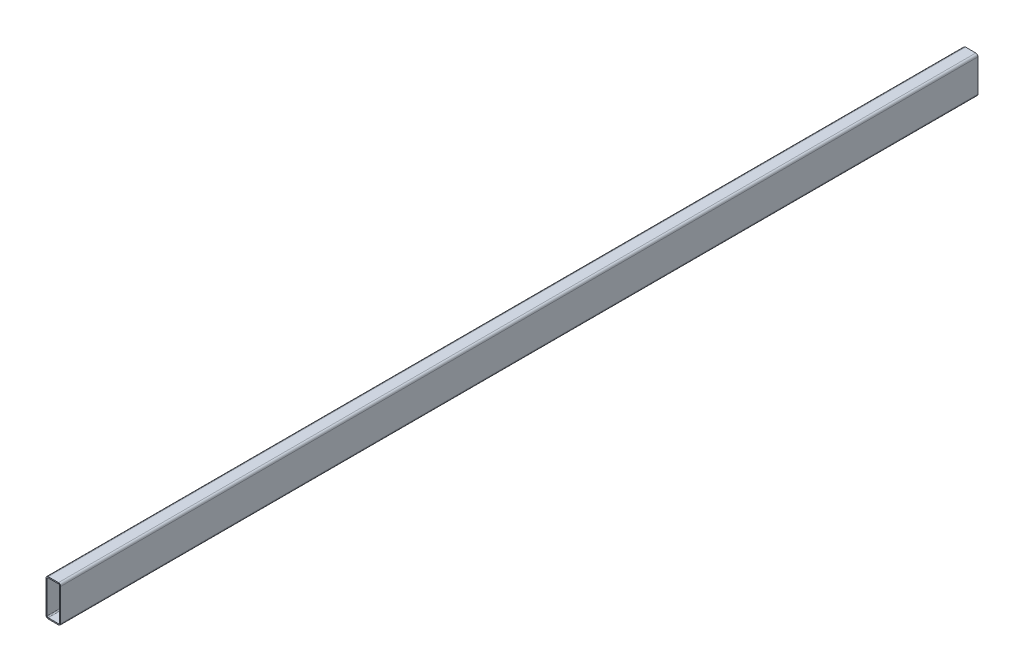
from build123d import *

# Parameters (mm, degrees)
EXTRUSION1_DEPTH = 2500


with BuildPart() as part:
    # Esquisse1 → Extrusion1 (new body)
    with BuildSketch(Plane.XY):
        with BuildLine():
            Line((6, 0), (34, 0))
            ThreePointArc((34, 0), (38.242640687, 1.757359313), (40, 6))
            Line((40, 6), (40, 94))
            ThreePointArc((40, 94), (38.242640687, 98.242640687), (34, 100))
            Line((34, 100), (6, 100))
            ThreePointArc((6, 100), (1.757359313, 98.242640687), (0, 94))
            Line((0, 94), (0, 6))
            ThreePointArc((0, 6), (1.757359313, 1.757359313), (6, 0))
        make_face()
        with BuildLine():
            Line((6, 3), (34, 3))
            ThreePointArc((34, 3), (36.121320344, 3.878679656), (37, 6))
            Line((37, 6), (37, 94))
            ThreePointArc((37, 94), (36.121320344, 96.121320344), (34, 97))
            Line((34, 97), (6, 97))
            ThreePointArc((6, 97), (3.878679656, 96.121320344), (3, 94))
            Line((3, 94), (3, 6))
            ThreePointArc((3, 6), (3.878679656, 3.878679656), (6, 3))
        make_face(mode=Mode.SUBTRACT)
    extrude(amount=EXTRUSION1_DEPTH)


solid = part.part
